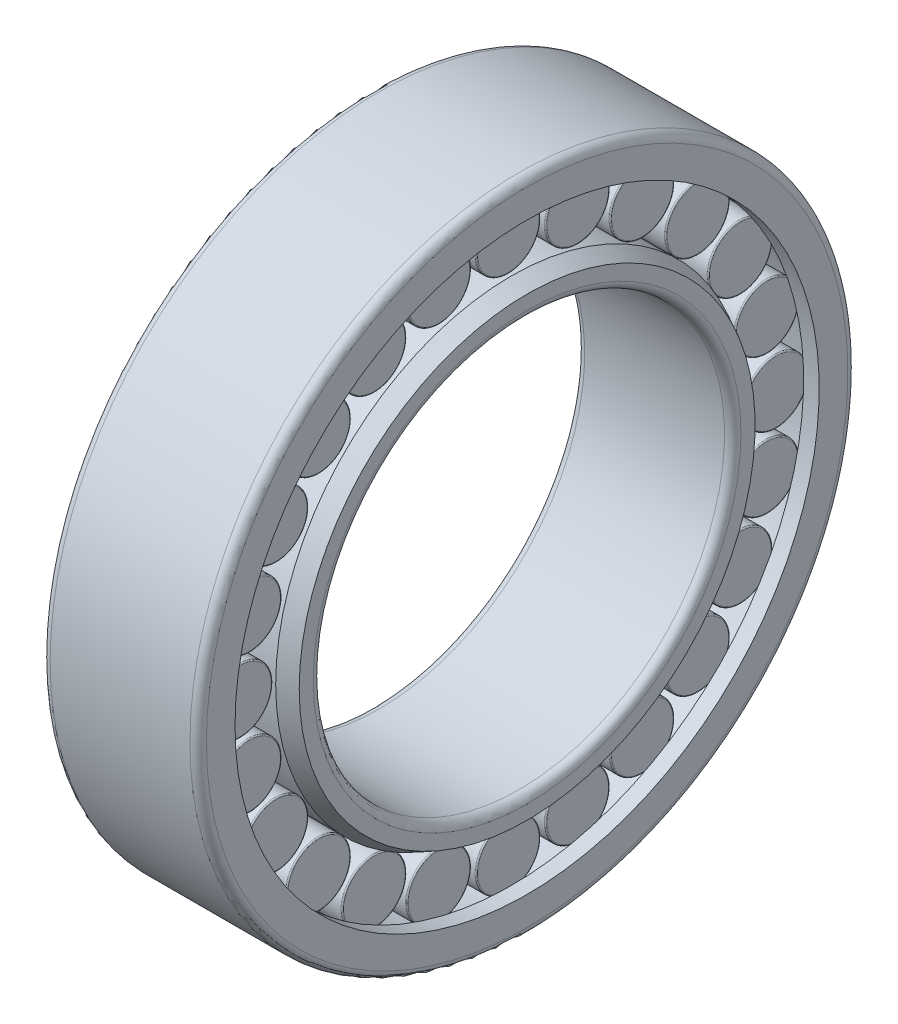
from build123d import *

# Parameters (mm, degrees)
CIRPATTERN1_COUNT = 24


with BuildPart() as part:
    # Sketch1 → Revolve2 (revolve)
    with BuildSketch(Plane.XY, mode=Mode.PRIVATE) as revolve2_sk:
        with BuildLine():
            Line((-7.6, 28.675), (7.6, 28.675))
            Line((7.6, 28.675), (9.5, 27.715))
            Line((9.5, 27.715), (9.5, 26))
            ThreePointArc((9.5, 26), (9.207106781, 25.292893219), (8.5, 25))
            Line((8.5, 25), (-8.5, 25))
            ThreePointArc((-8.5, 25), (-9.207106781, 25.292893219), (-9.5, 26))
            Line((-9.5, 26), (-9.5, 27.715))
            Line((-9.5, 27.715), (-7.6, 28.675))
        make_face()
    revolve(revolve2_sk.sketch.rotate(Axis((-17.910447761, 0, 0), (1, 0, 0)), 90), axis=Axis((-17.910447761, 0, 0), (1, 0, 0)))


with BuildPart() as body_2:
    # Sketch2 → Revolve3 (revolve)
    with BuildSketch(Plane.XY, mode=Mode.PRIVATE) as revolve3_sk:
        with BuildLine():
            Line((-7.07, 28.675), (7.07, 28.675))
            ThreePointArc((7.07, 28.675), (7.176066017, 28.718933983), (7.22, 28.825))
            Line((7.22, 28.825), (7.22, 32.5775))
            Line((7.22, 32.5775), (-7.22, 32.5775))
            Line((-7.22, 32.5775), (-7.22, 28.825))
            ThreePointArc((-7.22, 28.825), (-7.176066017, 28.718933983), (-7.07, 28.675))
        make_face()
    revolve(revolve3_sk.sketch.rotate(Axis((-10.13076685, 32.5775, 0), (1, 0, 0)), 270), axis=Axis((-10.13076685, 32.5775, 0), (1, 0, 0)))


with BuildPart() as body_3:
    # Sketch3 → Revolve4 (revolve)
    with BuildSketch(Plane.XY, mode=Mode.PRIVATE) as revolve4_sk:
        with BuildLine():
            Line((-7.6, 35.52), (-7.6, 36.48))
            Line((-7.6, 36.48), (7.6, 36.48))
            Line((7.6, 36.48), (7.6, 35.52))
            Line((7.6, 35.52), (9.5, 35.52))
            Line((9.5, 35.52), (9.5, 39))
            ThreePointArc((9.5, 39), (9.207106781, 39.707106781), (8.5, 40))
            Line((8.5, 40), (-8.5, 40))
            ThreePointArc((-8.5, 40), (-9.207106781, 39.707106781), (-9.5, 39))
            Line((-9.5, 39), (-9.5, 35.52))
            Line((-9.5, 35.52), (-7.6, 35.52))
        make_face()
    revolve(revolve4_sk.sketch.rotate(Axis((-25.766103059, 0, 0), (1, 0, 0)), 90), axis=Axis((-25.766103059, 0, 0), (1, 0, 0)))


with BuildPart() as cirpattern1_1:
    # CirPattern1: pattern copy
    add(body_2.part.rotate(Axis((0, 0, 0), (1, 0, 0)), 1 * 360 / CIRPATTERN1_COUNT))


with BuildPart() as cirpattern1_2:
    # CirPattern1: pattern copy
    add(body_2.part.rotate(Axis((0, 0, 0), (1, 0, 0)), 2 * 360 / CIRPATTERN1_COUNT))


with BuildPart() as cirpattern1_3:
    # CirPattern1: pattern copy
    add(body_2.part.rotate(Axis((0, 0, 0), (1, 0, 0)), 3 * 360 / CIRPATTERN1_COUNT))


with BuildPart() as cirpattern1_4:
    # CirPattern1: pattern copy
    add(body_2.part.rotate(Axis((0, 0, 0), (1, 0, 0)), 4 * 360 / CIRPATTERN1_COUNT))


with BuildPart() as cirpattern1_5:
    # CirPattern1: pattern copy
    add(body_2.part.rotate(Axis((0, 0, 0), (1, 0, 0)), 5 * 360 / CIRPATTERN1_COUNT))


with BuildPart() as cirpattern1_6:
    # CirPattern1: pattern copy
    add(body_2.part.rotate(Axis((0, 0, 0), (1, 0, 0)), 6 * 360 / CIRPATTERN1_COUNT))


with BuildPart() as cirpattern1_7:
    # CirPattern1: pattern copy
    add(body_2.part.rotate(Axis((0, 0, 0), (1, 0, 0)), 7 * 360 / CIRPATTERN1_COUNT))


with BuildPart() as cirpattern1_8:
    # CirPattern1: pattern copy
    add(body_2.part.rotate(Axis((0, 0, 0), (1, 0, 0)), 8 * 360 / CIRPATTERN1_COUNT))


with BuildPart() as cirpattern1_9:
    # CirPattern1: pattern copy
    add(body_2.part.rotate(Axis((0, 0, 0), (1, 0, 0)), 9 * 360 / CIRPATTERN1_COUNT))


with BuildPart() as cirpattern1_10:
    # CirPattern1: pattern copy
    add(body_2.part.rotate(Axis((0, 0, 0), (1, 0, 0)), 10 * 360 / CIRPATTERN1_COUNT))


with BuildPart() as cirpattern1_11:
    # CirPattern1: pattern copy
    add(body_2.part.rotate(Axis((0, 0, 0), (1, 0, 0)), 11 * 360 / CIRPATTERN1_COUNT))


with BuildPart() as cirpattern1_12:
    # CirPattern1: pattern copy
    add(body_2.part.rotate(Axis((0, 0, 0), (1, 0, 0)), 12 * 360 / CIRPATTERN1_COUNT))


with BuildPart() as cirpattern1_13:
    # CirPattern1: pattern copy
    add(body_2.part.rotate(Axis((0, 0, 0), (1, 0, 0)), 13 * 360 / CIRPATTERN1_COUNT))


with BuildPart() as cirpattern1_14:
    # CirPattern1: pattern copy
    add(body_2.part.rotate(Axis((0, 0, 0), (1, 0, 0)), 14 * 360 / CIRPATTERN1_COUNT))


with BuildPart() as cirpattern1_15:
    # CirPattern1: pattern copy
    add(body_2.part.rotate(Axis((0, 0, 0), (1, 0, 0)), 15 * 360 / CIRPATTERN1_COUNT))


with BuildPart() as cirpattern1_16:
    # CirPattern1: pattern copy
    add(body_2.part.rotate(Axis((0, 0, 0), (1, 0, 0)), 16 * 360 / CIRPATTERN1_COUNT))


with BuildPart() as cirpattern1_17:
    # CirPattern1: pattern copy
    add(body_2.part.rotate(Axis((0, 0, 0), (1, 0, 0)), 17 * 360 / CIRPATTERN1_COUNT))


with BuildPart() as cirpattern1_18:
    # CirPattern1: pattern copy
    add(body_2.part.rotate(Axis((0, 0, 0), (1, 0, 0)), 18 * 360 / CIRPATTERN1_COUNT))


with BuildPart() as cirpattern1_19:
    # CirPattern1: pattern copy
    add(body_2.part.rotate(Axis((0, 0, 0), (1, 0, 0)), 19 * 360 / CIRPATTERN1_COUNT))


with BuildPart() as cirpattern1_20:
    # CirPattern1: pattern copy
    add(body_2.part.rotate(Axis((0, 0, 0), (1, 0, 0)), 20 * 360 / CIRPATTERN1_COUNT))


with BuildPart() as cirpattern1_21:
    # CirPattern1: pattern copy
    add(body_2.part.rotate(Axis((0, 0, 0), (1, 0, 0)), 21 * 360 / CIRPATTERN1_COUNT))


with BuildPart() as cirpattern1_22:
    # CirPattern1: pattern copy
    add(body_2.part.rotate(Axis((0, 0, 0), (1, 0, 0)), 22 * 360 / CIRPATTERN1_COUNT))


with BuildPart() as cirpattern1_23:
    # CirPattern1: pattern copy
    add(body_2.part.rotate(Axis((0, 0, 0), (1, 0, 0)), 23 * 360 / CIRPATTERN1_COUNT))


solid = Compound([part.part, body_2.part, body_3.part, cirpattern1_1.part, cirpattern1_2.part, cirpattern1_3.part, cirpattern1_4.part, cirpattern1_5.part, cirpattern1_6.part, cirpattern1_7.part, cirpattern1_8.part, cirpattern1_9.part, cirpattern1_10.part, cirpattern1_11.part, cirpattern1_12.part, cirpattern1_13.part, cirpattern1_14.part, cirpattern1_15.part, cirpattern1_16.part, cirpattern1_17.part, cirpattern1_18.part, cirpattern1_19.part, cirpattern1_20.part, cirpattern1_21.part, cirpattern1_22.part, cirpattern1_23.part])
